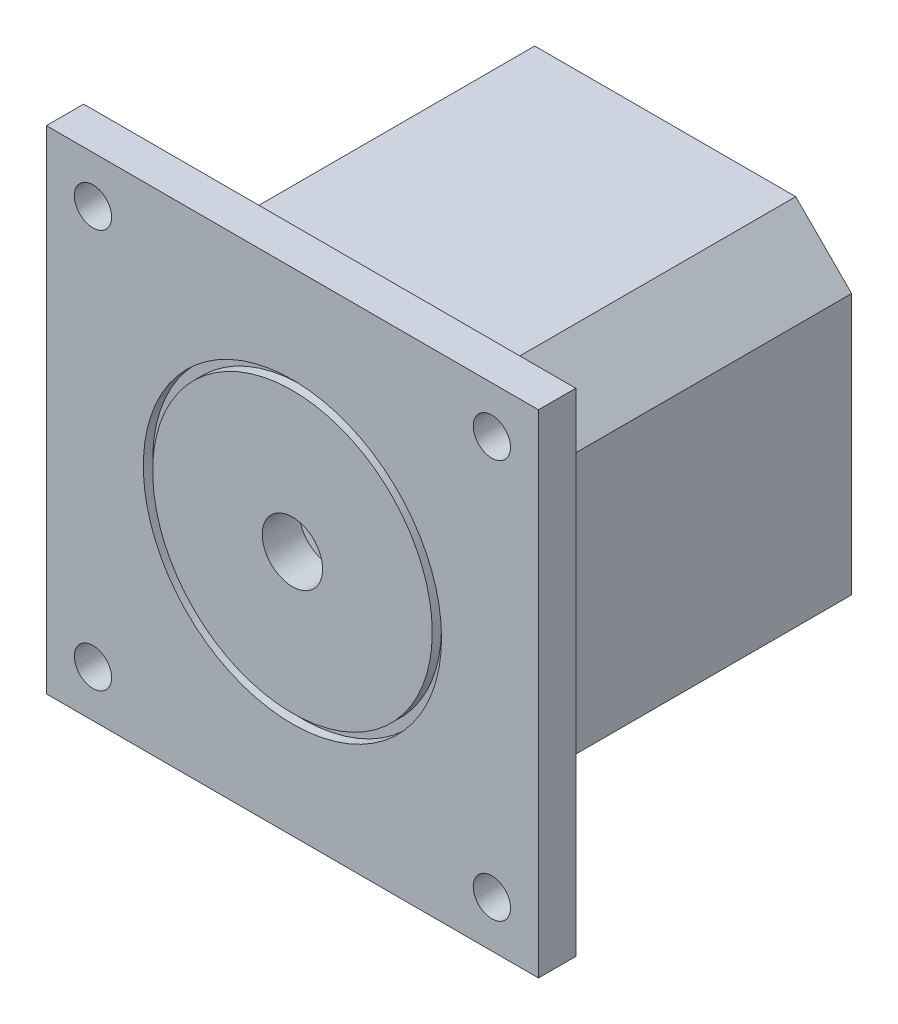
ISO-10303-21;
HEADER;
FILE_DESCRIPTION(('STEP AP214'),'2;1');
FILE_NAME('part.step','',(''),(''),'','','');
FILE_SCHEMA(('AUTOMOTIVE_DESIGN { 1 0 10303 214 1 1 1 1 }'));
ENDSEC;
DATA;
#1=APPLICATION_CONTEXT('core data for automotive mechanical design processes');
#2=APPLICATION_PROTOCOL_DEFINITION('international standard','automotive_design',2000,#1);
#3=PRODUCT_CONTEXT('',#1,'mechanical');
#4=PRODUCT('Part','Part','',(#3));
#5=PRODUCT_RELATED_PRODUCT_CATEGORY('part','',(#4));
#6=PRODUCT_DEFINITION_FORMATION('','',#4);
#7=PRODUCT_DEFINITION_CONTEXT('part definition',#1,'design');
#8=PRODUCT_DEFINITION('design','',#6,#7);
#9=PRODUCT_DEFINITION_SHAPE('','',#8);
#10=(LENGTH_UNIT() NAMED_UNIT(*) SI_UNIT(.MILLI.,.METRE.));
#11=(NAMED_UNIT(*) PLANE_ANGLE_UNIT() SI_UNIT($,.RADIAN.));
#12=(NAMED_UNIT(*) SI_UNIT($,.STERADIAN.) SOLID_ANGLE_UNIT());
#13=UNCERTAINTY_MEASURE_WITH_UNIT(LENGTH_MEASURE(1.E-05),#10,'distance_accuracy_value','');
#14=(GEOMETRIC_REPRESENTATION_CONTEXT(3) GLOBAL_UNCERTAINTY_ASSIGNED_CONTEXT((#13)) GLOBAL_UNIT_ASSIGNED_CONTEXT((#10,
#11,#12)) REPRESENTATION_CONTEXT('',''));
#15=CARTESIAN_POINT('',(0.,0.,0.));
#16=DIRECTION('',(0.,0.,1.));
#17=DIRECTION('',(1.,0.,0.));
#18=AXIS2_PLACEMENT_3D('',#15,#16,#17);
#19=CARTESIAN_POINT('',(-63.5,63.5,127.));
#20=DIRECTION('',(0.,0.,1.));
#21=DIRECTION('',(1.,0.,0.));
#22=AXIS2_PLACEMENT_3D('',#19,#20,#21);
#23=PLANE('',#22);
#24=CARTESIAN_POINT('',(0.,0.,127.));
#25=DIRECTION('',(0.,0.,1.));
#26=DIRECTION('',(1.,0.,0.));
#27=AXIS2_PLACEMENT_3D('',#24,#25,#26);
#28=CIRCLE('',#27,10.287);
#29=CARTESIAN_POINT('',(10.287,0.,127.));
#30=VERTEX_POINT('',#29);
#31=EDGE_CURVE('E394',#30,#30,#28,.T.);
#32=ORIENTED_EDGE('',*,*,#31,.F.);
#33=EDGE_LOOP('',(#32));
#34=FACE_BOUND('',#33,.T.);
#35=CARTESIAN_POINT('',(0.,0.,127.));
#36=DIRECTION('',(0.,0.,1.));
#37=DIRECTION('',(1.,0.,0.));
#38=AXIS2_PLACEMENT_3D('',#35,#36,#37);
#39=CIRCLE('',#38,47.625);
#40=CARTESIAN_POINT('',(47.625,0.,127.));
#41=VERTEX_POINT('',#40);
#42=EDGE_CURVE('E751',#41,#41,#39,.T.);
#43=ORIENTED_EDGE('',*,*,#42,.T.);
#44=EDGE_LOOP('',(#43));
#45=FACE_BOUND('',#44,.T.);
#46=ADVANCED_FACE('F29',(#34,#45),#23,.T.);
#47=CARTESIAN_POINT('',(83.82,83.82,114.3));
#48=DIRECTION('',(0.,0.,1.));
#49=DIRECTION('',(1.,0.,0.));
#50=AXIS2_PLACEMENT_3D('',#47,#48,#49);
#51=PLANE('',#50);
#52=CARTESIAN_POINT('',(-67.945,67.945,114.3));
#53=DIRECTION('',(0.,0.,-1.));
#54=DIRECTION('',(1.,0.,0.));
#55=AXIS2_PLACEMENT_3D('',#52,#53,#54);
#56=CIRCLE('',#55,6.34999999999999);
#57=CARTESIAN_POINT('',(-61.595,67.945,114.3));
#58=VERTEX_POINT('',#57);
#59=EDGE_CURVE('E379',#58,#58,#56,.T.);
#60=ORIENTED_EDGE('',*,*,#59,.F.);
#61=EDGE_LOOP('',(#60));
#62=FACE_BOUND('',#61,.T.);
#63=CARTESIAN_POINT('',(-67.945,-67.945,114.3));
#64=DIRECTION('',(0.,0.,1.));
#65=DIRECTION('',(1.,0.,0.));
#66=AXIS2_PLACEMENT_3D('',#63,#64,#65);
#67=CIRCLE('',#66,6.34999999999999);
#68=CARTESIAN_POINT('',(-61.595,-67.945,114.3));
#69=VERTEX_POINT('',#68);
#70=EDGE_CURVE('E376',#69,#69,#67,.T.);
#71=ORIENTED_EDGE('',*,*,#70,.T.);
#72=EDGE_LOOP('',(#71));
#73=FACE_BOUND('',#72,.T.);
#74=CARTESIAN_POINT('',(67.945,-67.945,114.3));
#75=DIRECTION('',(0.,0.,-1.));
#76=DIRECTION('',(-1.,0.,0.));
#77=AXIS2_PLACEMENT_3D('',#74,#75,#76);
#78=CIRCLE('',#77,6.34999999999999);
#79=CARTESIAN_POINT('',(61.595,-67.945,114.3));
#80=VERTEX_POINT('',#79);
#81=EDGE_CURVE('E388',#80,#80,#78,.T.);
#82=ORIENTED_EDGE('',*,*,#81,.F.);
#83=EDGE_LOOP('',(#82));
#84=FACE_BOUND('',#83,.T.);
#85=DIRECTION('',(0.,1.,0.));
#86=VECTOR('',#85,1.);
#87=CARTESIAN_POINT('',(83.82,-83.82,114.3));
#88=LINE('',#87,#86);
#89=CARTESIAN_POINT('',(83.82,-83.82,114.3));
#90=VERTEX_POINT('',#89);
#91=CARTESIAN_POINT('',(83.82,83.82,114.3));
#92=VERTEX_POINT('',#91);
#93=EDGE_CURVE('E174',#90,#92,#88,.T.);
#94=ORIENTED_EDGE('',*,*,#93,.F.);
#95=DIRECTION('',(1.,0.,0.));
#96=VECTOR('',#95,1.);
#97=CARTESIAN_POINT('',(-83.82,-83.82,114.3));
#98=LINE('',#97,#96);
#99=CARTESIAN_POINT('',(-83.82,-83.82,114.3));
#100=VERTEX_POINT('',#99);
#101=EDGE_CURVE('E179',#100,#90,#98,.T.);
#102=ORIENTED_EDGE('',*,*,#101,.F.);
#103=DIRECTION('',(0.,-1.,0.));
#104=VECTOR('',#103,1.);
#105=CARTESIAN_POINT('',(-83.82,83.82,114.3));
#106=LINE('',#105,#104);
#107=CARTESIAN_POINT('',(-83.82,83.82,114.3));
#108=VERTEX_POINT('',#107);
#109=EDGE_CURVE('E205',#108,#100,#106,.T.);
#110=ORIENTED_EDGE('',*,*,#109,.F.);
#111=DIRECTION('',(-1.,0.,0.));
#112=VECTOR('',#111,1.);
#113=CARTESIAN_POINT('',(83.82,83.82,114.3));
#114=LINE('',#113,#112);
#115=EDGE_CURVE('E203',#92,#108,#114,.T.);
#116=ORIENTED_EDGE('',*,*,#115,.F.);
#117=EDGE_LOOP('',(#94,#102,#110,#116));
#118=FACE_BOUND('',#117,.T.);
#119=DIRECTION('',(-0.707106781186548,0.707106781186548,0.));
#120=VECTOR('',#119,1.);
#121=CARTESIAN_POINT('',(63.5,44.45,114.3));
#122=LINE('',#121,#120);
#123=CARTESIAN_POINT('',(63.5,44.45,114.3));
#124=VERTEX_POINT('',#123);
#125=CARTESIAN_POINT('',(44.45,63.5,114.3));
#126=VERTEX_POINT('',#125);
#127=EDGE_CURVE('E236',#124,#126,#122,.T.);
#128=ORIENTED_EDGE('',*,*,#127,.T.);
#129=DIRECTION('',(-1.,0.,0.));
#130=VECTOR('',#129,1.);
#131=CARTESIAN_POINT('',(44.45,63.5,114.3));
#132=LINE('',#131,#130);
#133=CARTESIAN_POINT('',(-44.45,63.5,114.3));
#134=VERTEX_POINT('',#133);
#135=EDGE_CURVE('E253',#126,#134,#132,.T.);
#136=ORIENTED_EDGE('',*,*,#135,.T.);
#137=DIRECTION('',(-0.707106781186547,-0.707106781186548,0.));
#138=VECTOR('',#137,1.);
#139=CARTESIAN_POINT('',(-44.45,63.5,114.3));
#140=LINE('',#139,#138);
#141=CARTESIAN_POINT('',(-63.5,44.45,114.3));
#142=VERTEX_POINT('',#141);
#143=EDGE_CURVE('E44',#134,#142,#140,.T.);
#144=ORIENTED_EDGE('',*,*,#143,.T.);
#145=DIRECTION('',(0.,-1.,0.));
#146=VECTOR('',#145,1.);
#147=CARTESIAN_POINT('',(-63.5,44.45,114.3));
#148=LINE('',#147,#146);
#149=CARTESIAN_POINT('',(-63.5,-44.45,114.3));
#150=VERTEX_POINT('',#149);
#151=EDGE_CURVE('E52',#142,#150,#148,.T.);
#152=ORIENTED_EDGE('',*,*,#151,.T.);
#153=DIRECTION('',(0.707106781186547,-0.707106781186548,0.));
#154=VECTOR('',#153,1.);
#155=CARTESIAN_POINT('',(-63.5,-44.45,114.3));
#156=LINE('',#155,#154);
#157=CARTESIAN_POINT('',(-44.45,-63.5,114.3));
#158=VERTEX_POINT('',#157);
#159=EDGE_CURVE('E248',#150,#158,#156,.T.);
#160=ORIENTED_EDGE('',*,*,#159,.T.);
#161=DIRECTION('',(1.,0.,0.));
#162=VECTOR('',#161,1.);
#163=CARTESIAN_POINT('',(-44.45,-63.5,114.3));
#164=LINE('',#163,#162);
#165=CARTESIAN_POINT('',(44.45,-63.5,114.3));
#166=VERTEX_POINT('',#165);
#167=EDGE_CURVE('E245',#158,#166,#164,.T.);
#168=ORIENTED_EDGE('',*,*,#167,.T.);
#169=DIRECTION('',(0.707106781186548,0.707106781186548,0.));
#170=VECTOR('',#169,1.);
#171=CARTESIAN_POINT('',(44.45,-63.5,114.3));
#172=LINE('',#171,#170);
#173=CARTESIAN_POINT('',(63.5,-44.45,114.3));
#174=VERTEX_POINT('',#173);
#175=EDGE_CURVE('E242',#166,#174,#172,.T.);
#176=ORIENTED_EDGE('',*,*,#175,.T.);
#177=DIRECTION('',(0.,1.,0.));
#178=VECTOR('',#177,1.);
#179=CARTESIAN_POINT('',(63.5,-44.45,114.3));
#180=LINE('',#179,#178);
#181=EDGE_CURVE('E239',#174,#124,#180,.T.);
#182=ORIENTED_EDGE('',*,*,#181,.T.);
#183=EDGE_LOOP('',(#128,#136,#144,#152,#160,#168,#176,#182));
#184=FACE_BOUND('',#183,.T.);
#185=CARTESIAN_POINT('',(67.945,67.945,114.3));
#186=DIRECTION('',(0.,0.,1.));
#187=DIRECTION('',(-1.,0.,0.));
#188=AXIS2_PLACEMENT_3D('',#185,#186,#187);
#189=CIRCLE('',#188,6.34999999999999);
#190=CARTESIAN_POINT('',(61.595,67.945,114.3));
#191=VERTEX_POINT('',#190);
#192=EDGE_CURVE('E370',#191,#191,#189,.T.);
#193=ORIENTED_EDGE('',*,*,#192,.T.);
#194=EDGE_LOOP('',(#193));
#195=FACE_BOUND('',#194,.T.);
#196=ADVANCED_FACE('F362',(#62,#73,#84,#118,#184,#195),#51,.F.);
#197=CARTESIAN_POINT('',(0.,0.,127.));
#198=DIRECTION('',(0.,0.,1.));
#199=DIRECTION('',(1.,0.,0.));
#200=AXIS2_PLACEMENT_3D('',#197,#198,#199);
#201=CIRCLE('',#200,50.8);
#202=CARTESIAN_POINT('',(50.8,0.,127.));
#203=VERTEX_POINT('',#202);
#204=EDGE_CURVE('E436',#203,#203,#201,.T.);
#205=ORIENTED_EDGE('',*,*,#204,.F.);
#206=EDGE_LOOP('',(#205));
#207=FACE_BOUND('',#206,.T.);
#208=CARTESIAN_POINT('',(-67.945,67.945,127.));
#209=DIRECTION('',(0.,0.,-1.));
#210=DIRECTION('',(1.,0.,0.));
#211=AXIS2_PLACEMENT_3D('',#208,#209,#210);
#212=CIRCLE('',#211,6.34999999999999);
#213=CARTESIAN_POINT('',(-61.595,67.945,127.));
#214=VERTEX_POINT('',#213);
#215=EDGE_CURVE('E373',#214,#214,#212,.T.);
#216=ORIENTED_EDGE('',*,*,#215,.T.);
#217=EDGE_LOOP('',(#216));
#218=FACE_BOUND('',#217,.T.);
#219=CARTESIAN_POINT('',(-67.945,-67.945,127.));
#220=DIRECTION('',(0.,0.,1.));
#221=DIRECTION('',(1.,0.,0.));
#222=AXIS2_PLACEMENT_3D('',#219,#220,#221);
#223=CIRCLE('',#222,6.34999999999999);
#224=CARTESIAN_POINT('',(-61.595,-67.945,127.));
#225=VERTEX_POINT('',#224);
#226=EDGE_CURVE('E385',#225,#225,#223,.T.);
#227=ORIENTED_EDGE('',*,*,#226,.F.);
#228=EDGE_LOOP('',(#227));
#229=FACE_BOUND('',#228,.T.);
#230=CARTESIAN_POINT('',(67.945,-67.945,127.));
#231=DIRECTION('',(0.,0.,-1.));
#232=DIRECTION('',(-1.,0.,0.));
#233=AXIS2_PLACEMENT_3D('',#230,#231,#232);
#234=CIRCLE('',#233,6.34999999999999);
#235=CARTESIAN_POINT('',(61.595,-67.945,127.));
#236=VERTEX_POINT('',#235);
#237=EDGE_CURVE('E391',#236,#236,#234,.T.);
#238=ORIENTED_EDGE('',*,*,#237,.T.);
#239=EDGE_LOOP('',(#238));
#240=FACE_BOUND('',#239,.T.);
#241=DIRECTION('',(0.,1.,0.));
#242=VECTOR('',#241,1.);
#243=CARTESIAN_POINT('',(83.82,-83.82,127.));
#244=LINE('',#243,#242);
#245=CARTESIAN_POINT('',(83.82,-83.82,127.));
#246=VERTEX_POINT('',#245);
#247=CARTESIAN_POINT('',(83.82,83.82,127.));
#248=VERTEX_POINT('',#247);
#249=EDGE_CURVE('E171',#246,#248,#244,.T.);
#250=ORIENTED_EDGE('',*,*,#249,.T.);
#251=DIRECTION('',(-1.,0.,0.));
#252=VECTOR('',#251,1.);
#253=CARTESIAN_POINT('',(83.82,83.82,127.));
#254=LINE('',#253,#252);
#255=CARTESIAN_POINT('',(-83.82,83.82,127.));
#256=VERTEX_POINT('',#255);
#257=EDGE_CURVE('E182',#248,#256,#254,.T.);
#258=ORIENTED_EDGE('',*,*,#257,.T.);
#259=DIRECTION('',(0.,-1.,0.));
#260=VECTOR('',#259,1.);
#261=CARTESIAN_POINT('',(-83.82,83.82,127.));
#262=LINE('',#261,#260);
#263=CARTESIAN_POINT('',(-83.82,-83.82,127.));
#264=VERTEX_POINT('',#263);
#265=EDGE_CURVE('E187',#256,#264,#262,.T.);
#266=ORIENTED_EDGE('',*,*,#265,.T.);
#267=DIRECTION('',(1.,0.,0.));
#268=VECTOR('',#267,1.);
#269=CARTESIAN_POINT('',(-83.82,-83.82,127.));
#270=LINE('',#269,#268);
#271=EDGE_CURVE('E192',#264,#246,#270,.T.);
#272=ORIENTED_EDGE('',*,*,#271,.T.);
#273=EDGE_LOOP('',(#250,#258,#266,#272));
#274=FACE_BOUND('',#273,.T.);
#275=CARTESIAN_POINT('',(67.945,67.945,127.));
#276=DIRECTION('',(0.,0.,1.));
#277=DIRECTION('',(-1.,0.,0.));
#278=AXIS2_PLACEMENT_3D('',#275,#276,#277);
#279=CIRCLE('',#278,6.34999999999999);
#280=CARTESIAN_POINT('',(61.595,67.945,127.));
#281=VERTEX_POINT('',#280);
#282=EDGE_CURVE('E372',#281,#281,#279,.T.);
#283=ORIENTED_EDGE('',*,*,#282,.F.);
#284=EDGE_LOOP('',(#283));
#285=FACE_BOUND('',#284,.T.);
#286=ADVANCED_FACE('F189',(#207,#218,#229,#240,#274,#285),#23,.T.);
#287=CARTESIAN_POINT('',(44.45,63.5,127.));
#288=DIRECTION('',(0.,-1.,0.));
#289=DIRECTION('',(0.,0.,-1.));
#290=AXIS2_PLACEMENT_3D('',#287,#288,#289);
#291=PLANE('',#290);
#292=ORIENTED_EDGE('',*,*,#135,.F.);
#293=DIRECTION('',(0.,0.,-1.));
#294=VECTOR('',#293,1.);
#295=CARTESIAN_POINT('',(44.45,63.5,127.));
#296=LINE('',#295,#294);
#297=CARTESIAN_POINT('',(44.45,63.5,0.));
#298=VERTEX_POINT('',#297);
#299=EDGE_CURVE('E320',#126,#298,#296,.T.);
#300=ORIENTED_EDGE('',*,*,#299,.T.);
#301=DIRECTION('',(-1.,0.,0.));
#302=VECTOR('',#301,1.);
#303=CARTESIAN_POINT('',(44.45,63.5,0.));
#304=LINE('',#303,#302);
#305=CARTESIAN_POINT('',(-44.45,63.5,0.));
#306=VERTEX_POINT('',#305);
#307=EDGE_CURVE('E262',#298,#306,#304,.T.);
#308=ORIENTED_EDGE('',*,*,#307,.T.);
#309=DIRECTION('',(0.,0.,-1.));
#310=VECTOR('',#309,1.);
#311=CARTESIAN_POINT('',(-44.45,63.5,127.));
#312=LINE('',#311,#310);
#313=EDGE_CURVE('E37',#134,#306,#312,.T.);
#314=ORIENTED_EDGE('',*,*,#313,.F.);
#315=EDGE_LOOP('',(#292,#300,#308,#314));
#316=FACE_BOUND('',#315,.T.);
#317=ADVANCED_FACE('F31',(#316),#291,.F.);
#318=CARTESIAN_POINT('',(-44.45,63.5,127.));
#319=DIRECTION('',(0.707106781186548,-0.707106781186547,0.));
#320=DIRECTION('',(0.707106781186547,0.707106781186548,0.));
#321=AXIS2_PLACEMENT_3D('',#318,#319,#320);
#322=PLANE('',#321);
#323=ORIENTED_EDGE('',*,*,#143,.F.);
#324=ORIENTED_EDGE('',*,*,#313,.T.);
#325=DIRECTION('',(-0.707106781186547,-0.707106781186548,0.));
#326=VECTOR('',#325,1.);
#327=CARTESIAN_POINT('',(-44.45,63.5,0.));
#328=LINE('',#327,#326);
#329=CARTESIAN_POINT('',(-63.5,44.45,0.));
#330=VERTEX_POINT('',#329);
#331=EDGE_CURVE('E299',#306,#330,#328,.T.);
#332=ORIENTED_EDGE('',*,*,#331,.T.);
#333=DIRECTION('',(0.,0.,-1.));
#334=VECTOR('',#333,1.);
#335=CARTESIAN_POINT('',(-63.5,44.45,127.));
#336=LINE('',#335,#334);
#337=EDGE_CURVE('E332',#142,#330,#336,.T.);
#338=ORIENTED_EDGE('',*,*,#337,.F.);
#339=EDGE_LOOP('',(#323,#324,#332,#338));
#340=FACE_BOUND('',#339,.T.);
#341=ADVANCED_FACE('F334',(#340),#322,.F.);
#342=CARTESIAN_POINT('',(-63.5,44.45,127.));
#343=DIRECTION('',(1.,0.,0.));
#344=DIRECTION('',(0.,1.,0.));
#345=AXIS2_PLACEMENT_3D('',#342,#343,#344);
#346=PLANE('',#345);
#347=ORIENTED_EDGE('',*,*,#151,.F.);
#348=ORIENTED_EDGE('',*,*,#337,.T.);
#349=DIRECTION('',(0.,-1.,0.));
#350=VECTOR('',#349,1.);
#351=CARTESIAN_POINT('',(-63.5,44.45,0.));
#352=LINE('',#351,#350);
#353=CARTESIAN_POINT('',(-63.5,-44.45,0.));
#354=VERTEX_POINT('',#353);
#355=EDGE_CURVE('E302',#330,#354,#352,.T.);
#356=ORIENTED_EDGE('',*,*,#355,.T.);
#357=DIRECTION('',(0.,0.,-1.));
#358=VECTOR('',#357,1.);
#359=CARTESIAN_POINT('',(-63.5,-44.45,127.));
#360=LINE('',#359,#358);
#361=EDGE_CURVE('E330',#150,#354,#360,.T.);
#362=ORIENTED_EDGE('',*,*,#361,.F.);
#363=EDGE_LOOP('',(#347,#348,#356,#362));
#364=FACE_BOUND('',#363,.T.);
#365=ADVANCED_FACE('F360',(#364),#346,.F.);
#366=CARTESIAN_POINT('',(-63.5,-44.45,127.));
#367=DIRECTION('',(0.707106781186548,0.707106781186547,0.));
#368=DIRECTION('',(-0.707106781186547,0.707106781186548,0.));
#369=AXIS2_PLACEMENT_3D('',#366,#367,#368);
#370=PLANE('',#369);
#371=ORIENTED_EDGE('',*,*,#159,.F.);
#372=ORIENTED_EDGE('',*,*,#361,.T.);
#373=DIRECTION('',(0.707106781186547,-0.707106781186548,0.));
#374=VECTOR('',#373,1.);
#375=CARTESIAN_POINT('',(-63.5,-44.45,0.));
#376=LINE('',#375,#374);
#377=CARTESIAN_POINT('',(-44.45,-63.5,0.));
#378=VERTEX_POINT('',#377);
#379=EDGE_CURVE('E305',#354,#378,#376,.T.);
#380=ORIENTED_EDGE('',*,*,#379,.T.);
#381=DIRECTION('',(0.,0.,-1.));
#382=VECTOR('',#381,1.);
#383=CARTESIAN_POINT('',(-44.45,-63.5,127.));
#384=LINE('',#383,#382);
#385=EDGE_CURVE('E328',#158,#378,#384,.T.);
#386=ORIENTED_EDGE('',*,*,#385,.F.);
#387=EDGE_LOOP('',(#371,#372,#380,#386));
#388=FACE_BOUND('',#387,.T.);
#389=ADVANCED_FACE('F359',(#388),#370,.F.);
#390=CARTESIAN_POINT('',(-44.45,-63.5,127.));
#391=DIRECTION('',(0.,1.,0.));
#392=DIRECTION('',(0.,0.,1.));
#393=AXIS2_PLACEMENT_3D('',#390,#391,#392);
#394=PLANE('',#393);
#395=ORIENTED_EDGE('',*,*,#167,.F.);
#396=ORIENTED_EDGE('',*,*,#385,.T.);
#397=DIRECTION('',(1.,0.,0.));
#398=VECTOR('',#397,1.);
#399=CARTESIAN_POINT('',(-44.45,-63.5,0.));
#400=LINE('',#399,#398);
#401=CARTESIAN_POINT('',(44.45,-63.5,0.));
#402=VERTEX_POINT('',#401);
#403=EDGE_CURVE('E308',#378,#402,#400,.T.);
#404=ORIENTED_EDGE('',*,*,#403,.T.);
#405=DIRECTION('',(0.,0.,-1.));
#406=VECTOR('',#405,1.);
#407=CARTESIAN_POINT('',(44.45,-63.5,127.));
#408=LINE('',#407,#406);
#409=EDGE_CURVE('E326',#166,#402,#408,.T.);
#410=ORIENTED_EDGE('',*,*,#409,.F.);
#411=EDGE_LOOP('',(#395,#396,#404,#410));
#412=FACE_BOUND('',#411,.T.);
#413=ADVANCED_FACE('F356',(#412),#394,.F.);
#414=CARTESIAN_POINT('',(44.45,-63.5,127.));
#415=DIRECTION('',(-0.707106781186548,0.707106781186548,0.));
#416=DIRECTION('',(-0.707106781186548,-0.707106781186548,0.));
#417=AXIS2_PLACEMENT_3D('',#414,#415,#416);
#418=PLANE('',#417);
#419=ORIENTED_EDGE('',*,*,#175,.F.);
#420=ORIENTED_EDGE('',*,*,#409,.T.);
#421=DIRECTION('',(0.707106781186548,0.707106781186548,0.));
#422=VECTOR('',#421,1.);
#423=CARTESIAN_POINT('',(44.45,-63.5,0.));
#424=LINE('',#423,#422);
#425=CARTESIAN_POINT('',(63.5,-44.45,0.));
#426=VERTEX_POINT('',#425);
#427=EDGE_CURVE('E311',#402,#426,#424,.T.);
#428=ORIENTED_EDGE('',*,*,#427,.T.);
#429=DIRECTION('',(0.,0.,-1.));
#430=VECTOR('',#429,1.);
#431=CARTESIAN_POINT('',(63.5,-44.45,127.));
#432=LINE('',#431,#430);
#433=EDGE_CURVE('E324',#174,#426,#432,.T.);
#434=ORIENTED_EDGE('',*,*,#433,.F.);
#435=EDGE_LOOP('',(#419,#420,#428,#434));
#436=FACE_BOUND('',#435,.T.);
#437=ADVANCED_FACE('F353',(#436),#418,.F.);
#438=CARTESIAN_POINT('',(63.5,-44.45,127.));
#439=DIRECTION('',(-1.,0.,0.));
#440=DIRECTION('',(0.,-1.,0.));
#441=AXIS2_PLACEMENT_3D('',#438,#439,#440);
#442=PLANE('',#441);
#443=ORIENTED_EDGE('',*,*,#181,.F.);
#444=ORIENTED_EDGE('',*,*,#433,.T.);
#445=DIRECTION('',(0.,1.,0.));
#446=VECTOR('',#445,1.);
#447=CARTESIAN_POINT('',(63.5,-44.45,0.));
#448=LINE('',#447,#446);
#449=CARTESIAN_POINT('',(63.5,44.45,0.));
#450=VERTEX_POINT('',#449);
#451=EDGE_CURVE('E314',#426,#450,#448,.T.);
#452=ORIENTED_EDGE('',*,*,#451,.T.);
#453=DIRECTION('',(0.,0.,-1.));
#454=VECTOR('',#453,1.);
#455=CARTESIAN_POINT('',(63.5,44.45,127.));
#456=LINE('',#455,#454);
#457=EDGE_CURVE('E322',#124,#450,#456,.T.);
#458=ORIENTED_EDGE('',*,*,#457,.F.);
#459=EDGE_LOOP('',(#443,#444,#452,#458));
#460=FACE_BOUND('',#459,.T.);
#461=ADVANCED_FACE('F350',(#460),#442,.F.);
#462=CARTESIAN_POINT('',(63.5,44.45,127.));
#463=DIRECTION('',(-0.707106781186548,-0.707106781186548,0.));
#464=DIRECTION('',(0.707106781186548,-0.707106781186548,0.));
#465=AXIS2_PLACEMENT_3D('',#462,#463,#464);
#466=PLANE('',#465);
#467=ORIENTED_EDGE('',*,*,#127,.F.);
#468=ORIENTED_EDGE('',*,*,#457,.T.);
#469=DIRECTION('',(-0.707106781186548,0.707106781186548,0.));
#470=VECTOR('',#469,1.);
#471=CARTESIAN_POINT('',(63.5,44.45,0.));
#472=LINE('',#471,#470);
#473=EDGE_CURVE('E317',#450,#298,#472,.T.);
#474=ORIENTED_EDGE('',*,*,#473,.T.);
#475=ORIENTED_EDGE('',*,*,#299,.F.);
#476=EDGE_LOOP('',(#467,#468,#474,#475));
#477=FACE_BOUND('',#476,.T.);
#478=ADVANCED_FACE('F344',(#477),#466,.F.);
#479=CARTESIAN_POINT('',(-63.5,63.5,0.));
#480=DIRECTION('',(0.,0.,1.));
#481=DIRECTION('',(1.,0.,0.));
#482=AXIS2_PLACEMENT_3D('',#479,#480,#481);
#483=PLANE('',#482);
#484=CARTESIAN_POINT('',(0.,0.,0.));
#485=DIRECTION('',(0.,0.,-1.));
#486=DIRECTION('',(-1.,0.,0.));
#487=AXIS2_PLACEMENT_3D('',#484,#485,#486);
#488=CIRCLE('',#487,31.75);
#489=CARTESIAN_POINT('',(-31.75,0.,0.));
#490=VERTEX_POINT('',#489);
#491=EDGE_CURVE('E193',#490,#490,#488,.T.);
#492=ORIENTED_EDGE('',*,*,#491,.F.);
#493=EDGE_LOOP('',(#492));
#494=FACE_BOUND('',#493,.T.);
#495=ORIENTED_EDGE('',*,*,#307,.F.);
#496=ORIENTED_EDGE('',*,*,#473,.F.);
#497=ORIENTED_EDGE('',*,*,#451,.F.);
#498=ORIENTED_EDGE('',*,*,#427,.F.);
#499=ORIENTED_EDGE('',*,*,#403,.F.);
#500=ORIENTED_EDGE('',*,*,#379,.F.);
#501=ORIENTED_EDGE('',*,*,#355,.F.);
#502=ORIENTED_EDGE('',*,*,#331,.F.);
#503=EDGE_LOOP('',(#495,#496,#497,#498,#499,#500,#501,#502));
#504=FACE_BOUND('',#503,.T.);
#505=ADVANCED_FACE('F340',(#494,#504),#483,.F.);
#506=CARTESIAN_POINT('',(83.82,-83.82,114.3));
#507=DIRECTION('',(1.,0.,0.));
#508=DIRECTION('',(0.,1.,0.));
#509=AXIS2_PLACEMENT_3D('',#506,#507,#508);
#510=PLANE('',#509);
#511=ORIENTED_EDGE('',*,*,#249,.F.);
#512=DIRECTION('',(0.,0.,1.));
#513=VECTOR('',#512,1.);
#514=CARTESIAN_POINT('',(83.82,-83.82,114.3));
#515=LINE('',#514,#513);
#516=EDGE_CURVE('E210',#90,#246,#515,.T.);
#517=ORIENTED_EDGE('',*,*,#516,.F.);
#518=ORIENTED_EDGE('',*,*,#93,.T.);
#519=DIRECTION('',(0.,0.,1.));
#520=VECTOR('',#519,1.);
#521=CARTESIAN_POINT('',(83.82,83.82,114.3));
#522=LINE('',#521,#520);
#523=EDGE_CURVE('E167',#92,#248,#522,.T.);
#524=ORIENTED_EDGE('',*,*,#523,.T.);
#525=EDGE_LOOP('',(#511,#517,#518,#524));
#526=FACE_BOUND('',#525,.T.);
#527=ADVANCED_FACE('F169',(#526),#510,.T.);
#528=CARTESIAN_POINT('',(-83.82,-83.82,114.3));
#529=DIRECTION('',(0.,-1.,0.));
#530=DIRECTION('',(0.,0.,-1.));
#531=AXIS2_PLACEMENT_3D('',#528,#529,#530);
#532=PLANE('',#531);
#533=ORIENTED_EDGE('',*,*,#271,.F.);
#534=DIRECTION('',(0.,0.,1.));
#535=VECTOR('',#534,1.);
#536=CARTESIAN_POINT('',(-83.82,-83.82,114.3));
#537=LINE('',#536,#535);
#538=EDGE_CURVE('E213',#100,#264,#537,.T.);
#539=ORIENTED_EDGE('',*,*,#538,.F.);
#540=ORIENTED_EDGE('',*,*,#101,.T.);
#541=ORIENTED_EDGE('',*,*,#516,.T.);
#542=EDGE_LOOP('',(#533,#539,#540,#541));
#543=FACE_BOUND('',#542,.T.);
#544=ADVANCED_FACE('F417',(#543),#532,.T.);
#545=CARTESIAN_POINT('',(-83.82,83.82,114.3));
#546=DIRECTION('',(-1.,0.,0.));
#547=DIRECTION('',(0.,-1.,0.));
#548=AXIS2_PLACEMENT_3D('',#545,#546,#547);
#549=PLANE('',#548);
#550=ORIENTED_EDGE('',*,*,#265,.F.);
#551=DIRECTION('',(0.,0.,1.));
#552=VECTOR('',#551,1.);
#553=CARTESIAN_POINT('',(-83.82,83.82,114.3));
#554=LINE('',#553,#552);
#555=EDGE_CURVE('E178',#108,#256,#554,.T.);
#556=ORIENTED_EDGE('',*,*,#555,.F.);
#557=ORIENTED_EDGE('',*,*,#109,.T.);
#558=ORIENTED_EDGE('',*,*,#538,.T.);
#559=EDGE_LOOP('',(#550,#556,#557,#558));
#560=FACE_BOUND('',#559,.T.);
#561=ADVANCED_FACE('F456',(#560),#549,.T.);
#562=CARTESIAN_POINT('',(83.82,83.82,114.3));
#563=DIRECTION('',(0.,1.,0.));
#564=DIRECTION('',(0.,0.,1.));
#565=AXIS2_PLACEMENT_3D('',#562,#563,#564);
#566=PLANE('',#565);
#567=ORIENTED_EDGE('',*,*,#257,.F.);
#568=ORIENTED_EDGE('',*,*,#523,.F.);
#569=ORIENTED_EDGE('',*,*,#115,.T.);
#570=ORIENTED_EDGE('',*,*,#555,.T.);
#571=EDGE_LOOP('',(#567,#568,#569,#570));
#572=FACE_BOUND('',#571,.T.);
#573=ADVANCED_FACE('F183',(#572),#566,.T.);
#574=CARTESIAN_POINT('',(0.,0.,127.001));
#575=DIRECTION('',(0.,0.,-1.));
#576=DIRECTION('',(-1.,0.,0.));
#577=AXIS2_PLACEMENT_3D('',#574,#575,#576);
#578=CYLINDRICAL_SURFACE('',#577,31.75);
#579=CARTESIAN_POINT('',(0.,0.,6.35));
#580=DIRECTION('',(0.,0.,1.));
#581=DIRECTION('',(1.,0.,0.));
#582=AXIS2_PLACEMENT_3D('',#579,#580,#581);
#583=CIRCLE('',#582,31.75);
#584=CARTESIAN_POINT('',(31.75,0.,6.35));
#585=VERTEX_POINT('',#584);
#586=EDGE_CURVE('E196',#585,#585,#583,.F.);
#587=ORIENTED_EDGE('',*,*,#586,.F.);
#588=EDGE_LOOP('',(#587));
#589=FACE_BOUND('',#588,.T.);
#590=ORIENTED_EDGE('',*,*,#491,.T.);
#591=EDGE_LOOP('',(#590));
#592=FACE_BOUND('',#591,.T.);
#593=ADVANCED_FACE('F405',(#589,#592),#578,.F.);
#594=CARTESIAN_POINT('',(-63.5,63.5,6.35));
#595=DIRECTION('',(0.,0.,1.));
#596=DIRECTION('',(1.,0.,0.));
#597=AXIS2_PLACEMENT_3D('',#594,#595,#596);
#598=PLANE('',#597);
#599=ORIENTED_EDGE('',*,*,#586,.T.);
#600=EDGE_LOOP('',(#599));
#601=FACE_BOUND('',#600,.T.);
#602=DIRECTION('',(-1.,0.,0.));
#603=VECTOR('',#602,1.);
#604=CARTESIAN_POINT('',(44.45,57.15,6.34999999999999));
#605=LINE('',#604,#603);
#606=CARTESIAN_POINT('',(41.8197438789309,57.15,6.35));
#607=VERTEX_POINT('',#606);
#608=CARTESIAN_POINT('',(-41.8197438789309,57.15,6.35));
#609=VERTEX_POINT('',#608);
#610=EDGE_CURVE('E256',#607,#609,#605,.T.);
#611=ORIENTED_EDGE('',*,*,#610,.T.);
#612=DIRECTION('',(-0.707106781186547,-0.707106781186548,0.));
#613=VECTOR('',#612,1.);
#614=CARTESIAN_POINT('',(-39.9598719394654,59.0098719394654,6.34999999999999));
#615=LINE('',#614,#613);
#616=CARTESIAN_POINT('',(-57.15,41.8197438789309,6.35));
#617=VERTEX_POINT('',#616);
#618=EDGE_CURVE('E259',#609,#617,#615,.T.);
#619=ORIENTED_EDGE('',*,*,#618,.T.);
#620=DIRECTION('',(0.,-1.,0.));
#621=VECTOR('',#620,1.);
#622=CARTESIAN_POINT('',(-57.15,44.45,6.34999999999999));
#623=LINE('',#622,#621);
#624=CARTESIAN_POINT('',(-57.15,-41.8197438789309,6.35));
#625=VERTEX_POINT('',#624);
#626=EDGE_CURVE('E270',#617,#625,#623,.T.);
#627=ORIENTED_EDGE('',*,*,#626,.T.);
#628=DIRECTION('',(0.707106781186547,-0.707106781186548,0.));
#629=VECTOR('',#628,1.);
#630=CARTESIAN_POINT('',(-59.0098719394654,-39.9598719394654,6.34999999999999));
#631=LINE('',#630,#629);
#632=CARTESIAN_POINT('',(-41.8197438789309,-57.15,6.35));
#633=VERTEX_POINT('',#632);
#634=EDGE_CURVE('E275',#625,#633,#631,.T.);
#635=ORIENTED_EDGE('',*,*,#634,.T.);
#636=DIRECTION('',(1.,0.,0.));
#637=VECTOR('',#636,1.);
#638=CARTESIAN_POINT('',(-44.45,-57.15,6.34999999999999));
#639=LINE('',#638,#637);
#640=CARTESIAN_POINT('',(41.8197438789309,-57.15,6.35));
#641=VERTEX_POINT('',#640);
#642=EDGE_CURVE('E280',#633,#641,#639,.T.);
#643=ORIENTED_EDGE('',*,*,#642,.T.);
#644=DIRECTION('',(0.707106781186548,0.707106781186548,0.));
#645=VECTOR('',#644,1.);
#646=CARTESIAN_POINT('',(39.9598719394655,-59.0098719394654,6.34999999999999));
#647=LINE('',#646,#645);
#648=CARTESIAN_POINT('',(57.15,-41.8197438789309,6.35));
#649=VERTEX_POINT('',#648);
#650=EDGE_CURVE('E285',#641,#649,#647,.T.);
#651=ORIENTED_EDGE('',*,*,#650,.T.);
#652=DIRECTION('',(0.,1.,0.));
#653=VECTOR('',#652,1.);
#654=CARTESIAN_POINT('',(57.15,-44.45,6.34999999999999));
#655=LINE('',#654,#653);
#656=CARTESIAN_POINT('',(57.15,41.8197438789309,6.35));
#657=VERTEX_POINT('',#656);
#658=EDGE_CURVE('E290',#649,#657,#655,.T.);
#659=ORIENTED_EDGE('',*,*,#658,.T.);
#660=DIRECTION('',(-0.707106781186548,0.707106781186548,0.));
#661=VECTOR('',#660,1.);
#662=CARTESIAN_POINT('',(59.0098719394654,39.9598719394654,6.34999999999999));
#663=LINE('',#662,#661);
#664=EDGE_CURVE('E267',#657,#607,#663,.T.);
#665=ORIENTED_EDGE('',*,*,#664,.T.);
#666=EDGE_LOOP('',(#611,#619,#627,#635,#643,#651,#659,#665));
#667=FACE_BOUND('',#666,.T.);
#668=ADVANCED_FACE('F402',(#601,#667),#598,.T.);
#669=CARTESIAN_POINT('',(59.0098719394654,39.9598719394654,127.));
#670=DIRECTION('',(-0.707106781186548,-0.707106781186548,0.));
#671=DIRECTION('',(0.707106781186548,-0.707106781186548,0.));
#672=AXIS2_PLACEMENT_3D('',#669,#670,#671);
#673=PLANE('',#672);
#674=DIRECTION('',(0.,0.,-1.));
#675=VECTOR('',#674,1.);
#676=CARTESIAN_POINT('',(57.15,41.8197438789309,127.));
#677=LINE('',#676,#675);
#678=CARTESIAN_POINT('',(57.15,41.8197438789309,114.3));
#679=VERTEX_POINT('',#678);
#680=EDGE_CURVE('E266',#679,#657,#677,.T.);
#681=ORIENTED_EDGE('',*,*,#680,.F.);
#682=DIRECTION('',(-0.707106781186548,0.707106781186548,0.));
#683=VECTOR('',#682,1.);
#684=CARTESIAN_POINT('',(59.0098719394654,39.9598719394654,114.3));
#685=LINE('',#684,#683);
#686=CARTESIAN_POINT('',(41.8197438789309,57.15,114.3));
#687=VERTEX_POINT('',#686);
#688=EDGE_CURVE('E11',#679,#687,#685,.T.);
#689=ORIENTED_EDGE('',*,*,#688,.T.);
#690=DIRECTION('',(0.,0.,-1.));
#691=VECTOR('',#690,1.);
#692=CARTESIAN_POINT('',(41.8197438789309,57.15,127.));
#693=LINE('',#692,#691);
#694=EDGE_CURVE('E264',#687,#607,#693,.T.);
#695=ORIENTED_EDGE('',*,*,#694,.T.);
#696=ORIENTED_EDGE('',*,*,#664,.F.);
#697=EDGE_LOOP('',(#681,#689,#695,#696));
#698=FACE_BOUND('',#697,.T.);
#699=ADVANCED_FACE('F493',(#698),#673,.T.);
#700=CARTESIAN_POINT('',(57.15,-44.45,127.));
#701=DIRECTION('',(-1.,0.,0.));
#702=DIRECTION('',(0.,-1.,0.));
#703=AXIS2_PLACEMENT_3D('',#700,#701,#702);
#704=PLANE('',#703);
#705=DIRECTION('',(0.,0.,-1.));
#706=VECTOR('',#705,1.);
#707=CARTESIAN_POINT('',(57.15,-41.8197438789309,127.));
#708=LINE('',#707,#706);
#709=CARTESIAN_POINT('',(57.15,-41.8197438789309,114.3));
#710=VERTEX_POINT('',#709);
#711=EDGE_CURVE('E287',#710,#649,#708,.T.);
#712=ORIENTED_EDGE('',*,*,#711,.F.);
#713=DIRECTION('',(0.,1.,0.));
#714=VECTOR('',#713,1.);
#715=CARTESIAN_POINT('',(57.15,-44.45,114.3));
#716=LINE('',#715,#714);
#717=EDGE_CURVE('E212',#710,#679,#716,.T.);
#718=ORIENTED_EDGE('',*,*,#717,.T.);
#719=ORIENTED_EDGE('',*,*,#680,.T.);
#720=ORIENTED_EDGE('',*,*,#658,.F.);
#721=EDGE_LOOP('',(#712,#718,#719,#720));
#722=FACE_BOUND('',#721,.T.);
#723=ADVANCED_FACE('F489',(#722),#704,.T.);
#724=CARTESIAN_POINT('',(39.9598719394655,-59.0098719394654,127.));
#725=DIRECTION('',(-0.707106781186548,0.707106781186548,0.));
#726=DIRECTION('',(-0.707106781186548,-0.707106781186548,0.));
#727=AXIS2_PLACEMENT_3D('',#724,#725,#726);
#728=PLANE('',#727);
#729=DIRECTION('',(0.,0.,-1.));
#730=VECTOR('',#729,1.);
#731=CARTESIAN_POINT('',(41.8197438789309,-57.15,127.));
#732=LINE('',#731,#730);
#733=CARTESIAN_POINT('',(41.8197438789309,-57.15,114.3));
#734=VERTEX_POINT('',#733);
#735=EDGE_CURVE('E282',#734,#641,#732,.T.);
#736=ORIENTED_EDGE('',*,*,#735,.F.);
#737=DIRECTION('',(0.707106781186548,0.707106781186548,0.));
#738=VECTOR('',#737,1.);
#739=CARTESIAN_POINT('',(39.9598719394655,-59.0098719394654,114.3));
#740=LINE('',#739,#738);
#741=EDGE_CURVE('E218',#734,#710,#740,.T.);
#742=ORIENTED_EDGE('',*,*,#741,.T.);
#743=ORIENTED_EDGE('',*,*,#711,.T.);
#744=ORIENTED_EDGE('',*,*,#650,.F.);
#745=EDGE_LOOP('',(#736,#742,#743,#744));
#746=FACE_BOUND('',#745,.T.);
#747=ADVANCED_FACE('F485',(#746),#728,.T.);
#748=CARTESIAN_POINT('',(-44.45,-57.15,127.));
#749=DIRECTION('',(0.,1.,0.));
#750=DIRECTION('',(0.,0.,1.));
#751=AXIS2_PLACEMENT_3D('',#748,#749,#750);
#752=PLANE('',#751);
#753=DIRECTION('',(0.,0.,-1.));
#754=VECTOR('',#753,1.);
#755=CARTESIAN_POINT('',(-41.8197438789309,-57.15,127.));
#756=LINE('',#755,#754);
#757=CARTESIAN_POINT('',(-41.8197438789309,-57.15,114.3));
#758=VERTEX_POINT('',#757);
#759=EDGE_CURVE('E277',#758,#633,#756,.T.);
#760=ORIENTED_EDGE('',*,*,#759,.F.);
#761=DIRECTION('',(1.,0.,0.));
#762=VECTOR('',#761,1.);
#763=CARTESIAN_POINT('',(-44.45,-57.15,114.3));
#764=LINE('',#763,#762);
#765=EDGE_CURVE('E221',#758,#734,#764,.T.);
#766=ORIENTED_EDGE('',*,*,#765,.T.);
#767=ORIENTED_EDGE('',*,*,#735,.T.);
#768=ORIENTED_EDGE('',*,*,#642,.F.);
#769=EDGE_LOOP('',(#760,#766,#767,#768));
#770=FACE_BOUND('',#769,.T.);
#771=ADVANCED_FACE('F481',(#770),#752,.T.);
#772=CARTESIAN_POINT('',(-59.0098719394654,-39.9598719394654,127.));
#773=DIRECTION('',(0.707106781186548,0.707106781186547,0.));
#774=DIRECTION('',(-0.707106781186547,0.707106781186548,0.));
#775=AXIS2_PLACEMENT_3D('',#772,#773,#774);
#776=PLANE('',#775);
#777=DIRECTION('',(0.,0.,-1.));
#778=VECTOR('',#777,1.);
#779=CARTESIAN_POINT('',(-57.15,-41.8197438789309,127.));
#780=LINE('',#779,#778);
#781=CARTESIAN_POINT('',(-57.15,-41.8197438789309,114.3));
#782=VERTEX_POINT('',#781);
#783=EDGE_CURVE('E272',#782,#625,#780,.T.);
#784=ORIENTED_EDGE('',*,*,#783,.F.);
#785=DIRECTION('',(0.707106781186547,-0.707106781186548,0.));
#786=VECTOR('',#785,1.);
#787=CARTESIAN_POINT('',(-59.0098719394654,-39.9598719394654,114.3));
#788=LINE('',#787,#786);
#789=EDGE_CURVE('E224',#782,#758,#788,.T.);
#790=ORIENTED_EDGE('',*,*,#789,.T.);
#791=ORIENTED_EDGE('',*,*,#759,.T.);
#792=ORIENTED_EDGE('',*,*,#634,.F.);
#793=EDGE_LOOP('',(#784,#790,#791,#792));
#794=FACE_BOUND('',#793,.T.);
#795=ADVANCED_FACE('F477',(#794),#776,.T.);
#796=CARTESIAN_POINT('',(-57.15,44.45,127.));
#797=DIRECTION('',(1.,0.,0.));
#798=DIRECTION('',(0.,1.,0.));
#799=AXIS2_PLACEMENT_3D('',#796,#797,#798);
#800=PLANE('',#799);
#801=DIRECTION('',(0.,0.,-1.));
#802=VECTOR('',#801,1.);
#803=CARTESIAN_POINT('',(-57.15,41.8197438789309,127.));
#804=LINE('',#803,#802);
#805=CARTESIAN_POINT('',(-57.15,41.8197438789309,114.3));
#806=VERTEX_POINT('',#805);
#807=EDGE_CURVE('E263',#806,#617,#804,.T.);
#808=ORIENTED_EDGE('',*,*,#807,.F.);
#809=DIRECTION('',(0.,-1.,0.));
#810=VECTOR('',#809,1.);
#811=CARTESIAN_POINT('',(-57.15,44.45,114.3));
#812=LINE('',#811,#810);
#813=EDGE_CURVE('E227',#806,#782,#812,.T.);
#814=ORIENTED_EDGE('',*,*,#813,.T.);
#815=ORIENTED_EDGE('',*,*,#783,.T.);
#816=ORIENTED_EDGE('',*,*,#626,.F.);
#817=EDGE_LOOP('',(#808,#814,#815,#816));
#818=FACE_BOUND('',#817,.T.);
#819=ADVANCED_FACE('F473',(#818),#800,.T.);
#820=CARTESIAN_POINT('',(-39.9598719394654,59.0098719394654,127.));
#821=DIRECTION('',(0.707106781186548,-0.707106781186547,0.));
#822=DIRECTION('',(0.707106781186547,0.707106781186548,0.));
#823=AXIS2_PLACEMENT_3D('',#820,#821,#822);
#824=PLANE('',#823);
#825=DIRECTION('',(0.,0.,-1.));
#826=VECTOR('',#825,1.);
#827=CARTESIAN_POINT('',(-41.8197438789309,57.15,127.));
#828=LINE('',#827,#826);
#829=CARTESIAN_POINT('',(-41.8197438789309,57.15,114.3));
#830=VERTEX_POINT('',#829);
#831=EDGE_CURVE('E260',#830,#609,#828,.T.);
#832=ORIENTED_EDGE('',*,*,#831,.F.);
#833=DIRECTION('',(-0.707106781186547,-0.707106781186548,0.));
#834=VECTOR('',#833,1.);
#835=CARTESIAN_POINT('',(-39.9598719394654,59.0098719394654,114.3));
#836=LINE('',#835,#834);
#837=EDGE_CURVE('E230',#830,#806,#836,.T.);
#838=ORIENTED_EDGE('',*,*,#837,.T.);
#839=ORIENTED_EDGE('',*,*,#807,.T.);
#840=ORIENTED_EDGE('',*,*,#618,.F.);
#841=EDGE_LOOP('',(#832,#838,#839,#840));
#842=FACE_BOUND('',#841,.T.);
#843=ADVANCED_FACE('F469',(#842),#824,.T.);
#844=CARTESIAN_POINT('',(44.45,57.15,127.));
#845=DIRECTION('',(0.,-1.,0.));
#846=DIRECTION('',(0.,0.,-1.));
#847=AXIS2_PLACEMENT_3D('',#844,#845,#846);
#848=PLANE('',#847);
#849=ORIENTED_EDGE('',*,*,#694,.F.);
#850=DIRECTION('',(-1.,0.,0.));
#851=VECTOR('',#850,1.);
#852=CARTESIAN_POINT('',(44.45,57.15,114.3));
#853=LINE('',#852,#851);
#854=EDGE_CURVE('E233',#687,#830,#853,.T.);
#855=ORIENTED_EDGE('',*,*,#854,.T.);
#856=ORIENTED_EDGE('',*,*,#831,.T.);
#857=ORIENTED_EDGE('',*,*,#610,.F.);
#858=EDGE_LOOP('',(#849,#855,#856,#857));
#859=FACE_BOUND('',#858,.T.);
#860=ADVANCED_FACE('F466',(#859),#848,.T.);
#861=CARTESIAN_POINT('',(0.,0.,114.3));
#862=DIRECTION('',(0.,0.,1.));
#863=DIRECTION('',(1.,0.,0.));
#864=AXIS2_PLACEMENT_3D('',#861,#862,#863);
#865=CIRCLE('',#864,10.287);
#866=CARTESIAN_POINT('',(10.287,0.,114.3));
#867=VERTEX_POINT('',#866);
#868=EDGE_CURVE('E397',#867,#867,#865,.F.);
#869=ORIENTED_EDGE('',*,*,#868,.F.);
#870=EDGE_LOOP('',(#869));
#871=FACE_BOUND('',#870,.T.);
#872=ORIENTED_EDGE('',*,*,#854,.F.);
#873=ORIENTED_EDGE('',*,*,#688,.F.);
#874=ORIENTED_EDGE('',*,*,#717,.F.);
#875=ORIENTED_EDGE('',*,*,#741,.F.);
#876=ORIENTED_EDGE('',*,*,#765,.F.);
#877=ORIENTED_EDGE('',*,*,#789,.F.);
#878=ORIENTED_EDGE('',*,*,#813,.F.);
#879=ORIENTED_EDGE('',*,*,#837,.F.);
#880=EDGE_LOOP('',(#872,#873,#874,#875,#876,#877,#878,#879));
#881=FACE_BOUND('',#880,.T.);
#882=ADVANCED_FACE('F367',(#871,#881),#51,.F.);
#883=CARTESIAN_POINT('',(0.,0.,-0.001000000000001));
#884=DIRECTION('',(0.,0.,1.));
#885=DIRECTION('',(1.,0.,0.));
#886=AXIS2_PLACEMENT_3D('',#883,#884,#885);
#887=CYLINDRICAL_SURFACE('',#886,10.287);
#888=ORIENTED_EDGE('',*,*,#31,.T.);
#889=EDGE_LOOP('',(#888));
#890=FACE_BOUND('',#889,.T.);
#891=ORIENTED_EDGE('',*,*,#868,.T.);
#892=EDGE_LOOP('',(#891));
#893=FACE_BOUND('',#892,.T.);
#894=ADVANCED_FACE('F447',(#890,#893),#887,.F.);
#895=CARTESIAN_POINT('',(67.945,-67.945,127.));
#896=DIRECTION('',(0.,0.,-1.));
#897=DIRECTION('',(-1.,0.,0.));
#898=AXIS2_PLACEMENT_3D('',#895,#896,#897);
#899=CYLINDRICAL_SURFACE('',#898,6.34999999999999);
#900=ORIENTED_EDGE('',*,*,#237,.F.);
#901=EDGE_LOOP('',(#900));
#902=FACE_BOUND('',#901,.T.);
#903=ORIENTED_EDGE('',*,*,#81,.T.);
#904=EDGE_LOOP('',(#903));
#905=FACE_BOUND('',#904,.T.);
#906=ADVANCED_FACE('F443',(#902,#905),#899,.F.);
#907=CARTESIAN_POINT('',(-67.945,-67.945,127.));
#908=DIRECTION('',(0.,0.,-1.));
#909=DIRECTION('',(-1.,0.,0.));
#910=AXIS2_PLACEMENT_3D('',#907,#908,#909);
#911=CYLINDRICAL_SURFACE('',#910,6.34999999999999);
#912=ORIENTED_EDGE('',*,*,#226,.T.);
#913=EDGE_LOOP('',(#912));
#914=FACE_BOUND('',#913,.T.);
#915=ORIENTED_EDGE('',*,*,#70,.F.);
#916=EDGE_LOOP('',(#915));
#917=FACE_BOUND('',#916,.T.);
#918=ADVANCED_FACE('F446',(#914,#917),#911,.F.);
#919=CARTESIAN_POINT('',(67.945,67.945,127.));
#920=DIRECTION('',(0.,0.,-1.));
#921=DIRECTION('',(-1.,0.,0.));
#922=AXIS2_PLACEMENT_3D('',#919,#920,#921);
#923=CYLINDRICAL_SURFACE('',#922,6.34999999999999);
#924=ORIENTED_EDGE('',*,*,#282,.T.);
#925=EDGE_LOOP('',(#924));
#926=FACE_BOUND('',#925,.T.);
#927=ORIENTED_EDGE('',*,*,#192,.F.);
#928=EDGE_LOOP('',(#927));
#929=FACE_BOUND('',#928,.T.);
#930=ADVANCED_FACE('F557',(#926,#929),#923,.F.);
#931=CARTESIAN_POINT('',(-67.945,67.945,127.));
#932=DIRECTION('',(0.,0.,-1.));
#933=DIRECTION('',(-1.,0.,0.));
#934=AXIS2_PLACEMENT_3D('',#931,#932,#933);
#935=CYLINDRICAL_SURFACE('',#934,6.34999999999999);
#936=ORIENTED_EDGE('',*,*,#215,.F.);
#937=EDGE_LOOP('',(#936));
#938=FACE_BOUND('',#937,.T.);
#939=ORIENTED_EDGE('',*,*,#59,.T.);
#940=EDGE_LOOP('',(#939));
#941=FACE_BOUND('',#940,.T.);
#942=ADVANCED_FACE('F565',(#938,#941),#935,.F.);
#943=CARTESIAN_POINT('',(0.,0.,123.825));
#944=DIRECTION('',(0.,0.,1.));
#945=DIRECTION('',(1.,0.,0.));
#946=AXIS2_PLACEMENT_3D('',#943,#944,#945);
#947=CYLINDRICAL_SURFACE('',#946,50.8);
#948=CARTESIAN_POINT('',(0.,0.,123.825));
#949=DIRECTION('',(0.,0.,1.));
#950=DIRECTION('',(1.,0.,0.));
#951=AXIS2_PLACEMENT_3D('',#948,#949,#950);
#952=CIRCLE('',#951,50.8);
#953=CARTESIAN_POINT('',(50.8,0.,123.825));
#954=VERTEX_POINT('',#953);
#955=EDGE_CURVE('E756',#954,#954,#952,.T.);
#956=ORIENTED_EDGE('',*,*,#955,.F.);
#957=EDGE_LOOP('',(#956));
#958=FACE_BOUND('',#957,.T.);
#959=ORIENTED_EDGE('',*,*,#204,.T.);
#960=EDGE_LOOP('',(#959));
#961=FACE_BOUND('',#960,.T.);
#962=ADVANCED_FACE('F573',(#958,#961),#947,.F.);
#963=CARTESIAN_POINT('',(0.,0.,123.825));
#964=DIRECTION('',(0.,0.,1.));
#965=DIRECTION('',(1.,0.,0.));
#966=AXIS2_PLACEMENT_3D('',#963,#964,#965);
#967=PLANE('',#966);
#968=CARTESIAN_POINT('',(0.,0.,123.825));
#969=DIRECTION('',(0.,0.,1.));
#970=DIRECTION('',(1.,0.,0.));
#971=AXIS2_PLACEMENT_3D('',#968,#969,#970);
#972=CIRCLE('',#971,47.625);
#973=CARTESIAN_POINT('',(47.625,0.,123.825));
#974=VERTEX_POINT('',#973);
#975=EDGE_CURVE('E748',#974,#974,#972,.T.);
#976=ORIENTED_EDGE('',*,*,#975,.F.);
#977=EDGE_LOOP('',(#976));
#978=FACE_BOUND('',#977,.T.);
#979=ORIENTED_EDGE('',*,*,#955,.T.);
#980=EDGE_LOOP('',(#979));
#981=FACE_BOUND('',#980,.T.);
#982=ADVANCED_FACE('F581',(#978,#981),#967,.T.);
#983=CARTESIAN_POINT('',(0.,0.,123.825));
#984=DIRECTION('',(0.,0.,1.));
#985=DIRECTION('',(1.,0.,0.));
#986=AXIS2_PLACEMENT_3D('',#983,#984,#985);
#987=CYLINDRICAL_SURFACE('',#986,47.625);
#988=ORIENTED_EDGE('',*,*,#975,.T.);
#989=EDGE_LOOP('',(#988));
#990=FACE_BOUND('',#989,.T.);
#991=ORIENTED_EDGE('',*,*,#42,.F.);
#992=EDGE_LOOP('',(#991));
#993=FACE_BOUND('',#992,.T.);
#994=ADVANCED_FACE('F589',(#990,#993),#987,.T.);
#995=CLOSED_SHELL('',(#46,#196,#286,#317,#341,#365,#389,#413,#437,#461,#478,#505,#527,#544,#561,
#573,#593,#668,#699,#723,#747,#771,#795,#819,#843,#860,#882,#894,#906,#918,#930,#942,#962,#982,#994));
#996=MANIFOLD_SOLID_BREP('B2',#995);
#997=ADVANCED_BREP_SHAPE_REPRESENTATION('',(#18,#996),#14);
#998=SHAPE_DEFINITION_REPRESENTATION(#9,#997);
ENDSEC;
END-ISO-10303-21;
